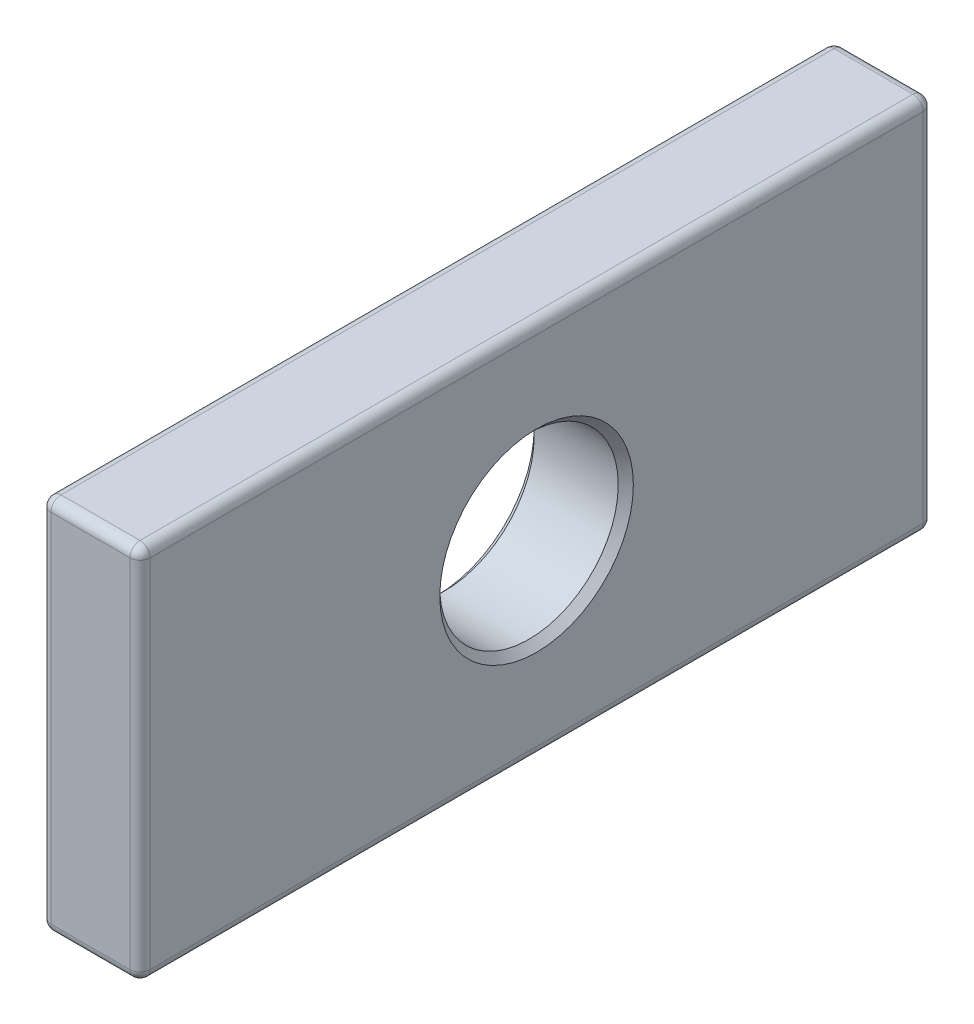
ISO-10303-21;
HEADER;
FILE_DESCRIPTION(('STEP AP214'),'2;1');
FILE_NAME('part.step','',(''),(''),'','','');
FILE_SCHEMA(('AUTOMOTIVE_DESIGN { 1 0 10303 214 1 1 1 1 }'));
ENDSEC;
DATA;
#1=APPLICATION_CONTEXT('core data for automotive mechanical design processes');
#2=APPLICATION_PROTOCOL_DEFINITION('international standard','automotive_design',2000,#1);
#3=PRODUCT_CONTEXT('',#1,'mechanical');
#4=PRODUCT('Part','Part','',(#3));
#5=PRODUCT_RELATED_PRODUCT_CATEGORY('part','',(#4));
#6=PRODUCT_DEFINITION_FORMATION('','',#4);
#7=PRODUCT_DEFINITION_CONTEXT('part definition',#1,'design');
#8=PRODUCT_DEFINITION('design','',#6,#7);
#9=PRODUCT_DEFINITION_SHAPE('','',#8);
#10=(LENGTH_UNIT() NAMED_UNIT(*) SI_UNIT(.MILLI.,.METRE.));
#11=(NAMED_UNIT(*) PLANE_ANGLE_UNIT() SI_UNIT($,.RADIAN.));
#12=(NAMED_UNIT(*) SI_UNIT($,.STERADIAN.) SOLID_ANGLE_UNIT());
#13=UNCERTAINTY_MEASURE_WITH_UNIT(LENGTH_MEASURE(1.E-05),#10,'distance_accuracy_value','');
#14=(GEOMETRIC_REPRESENTATION_CONTEXT(3) GLOBAL_UNCERTAINTY_ASSIGNED_CONTEXT((#13)) GLOBAL_UNIT_ASSIGNED_CONTEXT((#10,
#11,#12)) REPRESENTATION_CONTEXT('',''));
#15=CARTESIAN_POINT('',(0.,0.,0.));
#16=DIRECTION('',(0.,0.,1.));
#17=DIRECTION('',(1.,0.,0.));
#18=AXIS2_PLACEMENT_3D('',#15,#16,#17);
#19=CARTESIAN_POINT('',(5.,0.,0.));
#20=DIRECTION('',(1.,0.,0.));
#21=DIRECTION('',(0.,0.,-1.));
#22=AXIS2_PLACEMENT_3D('',#19,#20,#21);
#23=PLANE('',#22);
#24=CARTESIAN_POINT('',(5.,0.,0.));
#25=DIRECTION('',(1.,0.,0.));
#26=DIRECTION('',(0.,0.,-1.));
#27=AXIS2_PLACEMENT_3D('',#24,#25,#26);
#28=CIRCLE('',#27,9.76200000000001);
#29=CARTESIAN_POINT('',(5.,0.,-9.762));
#30=VERTEX_POINT('',#29);
#31=EDGE_CURVE('E11',#30,#30,#28,.F.);
#32=ORIENTED_EDGE('',*,*,#31,.T.);
#33=EDGE_LOOP('',(#32));
#34=FACE_BOUND('',#33,.T.);
#35=DIRECTION('',(0.,0.,-1.));
#36=VECTOR('',#35,1.);
#37=CARTESIAN_POINT('',(5.,-17.984,-40.));
#38=LINE('',#37,#36);
#39=CARTESIAN_POINT('',(5.,-17.984,38.984));
#40=VERTEX_POINT('',#39);
#41=CARTESIAN_POINT('',(5.,-17.984,-38.984));
#42=VERTEX_POINT('',#41);
#43=EDGE_CURVE('E130',#40,#42,#38,.T.);
#44=ORIENTED_EDGE('',*,*,#43,.T.);
#45=DIRECTION('',(0.,1.,0.));
#46=VECTOR('',#45,1.);
#47=CARTESIAN_POINT('',(5.,19.,-38.984));
#48=LINE('',#47,#46);
#49=CARTESIAN_POINT('',(5.,17.984,-38.984));
#50=VERTEX_POINT('',#49);
#51=EDGE_CURVE('E126',#42,#50,#48,.T.);
#52=ORIENTED_EDGE('',*,*,#51,.T.);
#53=DIRECTION('',(0.,0.,1.));
#54=VECTOR('',#53,1.);
#55=CARTESIAN_POINT('',(5.,17.984,40.));
#56=LINE('',#55,#54);
#57=CARTESIAN_POINT('',(5.,17.984,38.984));
#58=VERTEX_POINT('',#57);
#59=EDGE_CURVE('E119',#50,#58,#56,.T.);
#60=ORIENTED_EDGE('',*,*,#59,.T.);
#61=DIRECTION('',(0.,-1.,0.));
#62=VECTOR('',#61,1.);
#63=CARTESIAN_POINT('',(5.,-19.,38.984));
#64=LINE('',#63,#62);
#65=EDGE_CURVE('E123',#58,#40,#64,.T.);
#66=ORIENTED_EDGE('',*,*,#65,.T.);
#67=EDGE_LOOP('',(#44,#52,#60,#66));
#68=FACE_BOUND('',#67,.T.);
#69=ADVANCED_FACE('F32',(#34,#68),#23,.T.);
#70=CARTESIAN_POINT('',(-5.,0.,0.));
#71=DIRECTION('',(1.,0.,0.));
#72=DIRECTION('',(0.,0.,-1.));
#73=AXIS2_PLACEMENT_3D('',#70,#71,#72);
#74=PLANE('',#73);
#75=CARTESIAN_POINT('',(-5.,0.,0.));
#76=DIRECTION('',(1.,0.,0.));
#77=DIRECTION('',(0.,0.,-1.));
#78=AXIS2_PLACEMENT_3D('',#75,#76,#77);
#79=CIRCLE('',#78,9.76199999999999);
#80=CARTESIAN_POINT('',(-5.,0.,-9.76199999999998));
#81=VERTEX_POINT('',#80);
#82=EDGE_CURVE('E204',#81,#81,#79,.T.);
#83=ORIENTED_EDGE('',*,*,#82,.T.);
#84=EDGE_LOOP('',(#83));
#85=FACE_BOUND('',#84,.T.);
#86=DIRECTION('',(0.,0.,1.));
#87=VECTOR('',#86,1.);
#88=CARTESIAN_POINT('',(-5.,17.984,0.));
#89=LINE('',#88,#87);
#90=CARTESIAN_POINT('',(-5.,17.984,38.984));
#91=VERTEX_POINT('',#90);
#92=CARTESIAN_POINT('',(-5.,17.984,-38.984));
#93=VERTEX_POINT('',#92);
#94=EDGE_CURVE('E175',#91,#93,#89,.F.);
#95=ORIENTED_EDGE('',*,*,#94,.T.);
#96=DIRECTION('',(0.,1.,0.));
#97=VECTOR('',#96,1.);
#98=CARTESIAN_POINT('',(-5.,0.,-38.984));
#99=LINE('',#98,#97);
#100=CARTESIAN_POINT('',(-5.,-17.984,-38.984));
#101=VERTEX_POINT('',#100);
#102=EDGE_CURVE('E180',#93,#101,#99,.F.);
#103=ORIENTED_EDGE('',*,*,#102,.T.);
#104=DIRECTION('',(0.,0.,-1.));
#105=VECTOR('',#104,1.);
#106=CARTESIAN_POINT('',(-5.,-17.984,0.));
#107=LINE('',#106,#105);
#108=CARTESIAN_POINT('',(-5.,-17.984,38.984));
#109=VERTEX_POINT('',#108);
#110=EDGE_CURVE('E177',#101,#109,#107,.F.);
#111=ORIENTED_EDGE('',*,*,#110,.T.);
#112=DIRECTION('',(0.,-1.,0.));
#113=VECTOR('',#112,1.);
#114=CARTESIAN_POINT('',(-5.,0.,38.984));
#115=LINE('',#114,#113);
#116=EDGE_CURVE('E173',#109,#91,#115,.F.);
#117=ORIENTED_EDGE('',*,*,#116,.T.);
#118=EDGE_LOOP('',(#95,#103,#111,#117));
#119=FACE_BOUND('',#118,.T.);
#120=ADVANCED_FACE('F270',(#85,#119),#74,.F.);
#121=CARTESIAN_POINT('',(5.,19.,-40.));
#122=DIRECTION('',(0.,0.,1.));
#123=DIRECTION('',(1.,0.,0.));
#124=AXIS2_PLACEMENT_3D('',#121,#122,#123);
#125=PLANE('',#124);
#126=DIRECTION('',(0.,1.,0.));
#127=VECTOR('',#126,1.);
#128=CARTESIAN_POINT('',(3.984,-19.,-40.));
#129=LINE('',#128,#127);
#130=CARTESIAN_POINT('',(3.984,17.984,-40.));
#131=VERTEX_POINT('',#130);
#132=CARTESIAN_POINT('',(3.984,-17.984,-40.));
#133=VERTEX_POINT('',#132);
#134=EDGE_CURVE('E193',#131,#133,#129,.F.);
#135=ORIENTED_EDGE('',*,*,#134,.T.);
#136=DIRECTION('',(-1.,0.,0.));
#137=VECTOR('',#136,1.);
#138=CARTESIAN_POINT('',(5.,-17.984,-40.));
#139=LINE('',#138,#137);
#140=CARTESIAN_POINT('',(-3.984,-17.984,-40.));
#141=VERTEX_POINT('',#140);
#142=EDGE_CURVE('E195',#133,#141,#139,.T.);
#143=ORIENTED_EDGE('',*,*,#142,.T.);
#144=DIRECTION('',(0.,1.,0.));
#145=VECTOR('',#144,1.);
#146=CARTESIAN_POINT('',(-3.984,19.,-40.));
#147=LINE('',#146,#145);
#148=CARTESIAN_POINT('',(-3.984,17.984,-40.));
#149=VERTEX_POINT('',#148);
#150=EDGE_CURVE('E189',#141,#149,#147,.T.);
#151=ORIENTED_EDGE('',*,*,#150,.T.);
#152=DIRECTION('',(-1.,0.,0.));
#153=VECTOR('',#152,1.);
#154=CARTESIAN_POINT('',(5.,17.984,-40.));
#155=LINE('',#154,#153);
#156=EDGE_CURVE('E191',#149,#131,#155,.F.);
#157=ORIENTED_EDGE('',*,*,#156,.T.);
#158=EDGE_LOOP('',(#135,#143,#151,#157));
#159=FACE_BOUND('',#158,.T.);
#160=ADVANCED_FACE('F273',(#159),#125,.F.);
#161=CARTESIAN_POINT('',(5.,19.,40.));
#162=DIRECTION('',(0.,-1.,0.));
#163=DIRECTION('',(0.,0.,-1.));
#164=AXIS2_PLACEMENT_3D('',#161,#162,#163);
#165=PLANE('',#164);
#166=DIRECTION('',(0.,0.,1.));
#167=VECTOR('',#166,1.);
#168=CARTESIAN_POINT('',(3.984,19.,-40.));
#169=LINE('',#168,#167);
#170=CARTESIAN_POINT('',(3.984,19.,38.984));
#171=VERTEX_POINT('',#170);
#172=CARTESIAN_POINT('',(3.984,19.,-38.984));
#173=VERTEX_POINT('',#172);
#174=EDGE_CURVE('E138',#171,#173,#169,.F.);
#175=ORIENTED_EDGE('',*,*,#174,.T.);
#176=DIRECTION('',(-1.,0.,0.));
#177=VECTOR('',#176,1.);
#178=CARTESIAN_POINT('',(5.,19.,-38.984));
#179=LINE('',#178,#177);
#180=CARTESIAN_POINT('',(-3.984,19.,-38.984));
#181=VERTEX_POINT('',#180);
#182=EDGE_CURVE('E187',#173,#181,#179,.T.);
#183=ORIENTED_EDGE('',*,*,#182,.T.);
#184=DIRECTION('',(0.,0.,1.));
#185=VECTOR('',#184,1.);
#186=CARTESIAN_POINT('',(-3.984,19.,40.));
#187=LINE('',#186,#185);
#188=CARTESIAN_POINT('',(-3.984,19.,38.984));
#189=VERTEX_POINT('',#188);
#190=EDGE_CURVE('E184',#181,#189,#187,.T.);
#191=ORIENTED_EDGE('',*,*,#190,.T.);
#192=DIRECTION('',(-1.,0.,0.));
#193=VECTOR('',#192,1.);
#194=CARTESIAN_POINT('',(5.,19.,38.984));
#195=LINE('',#194,#193);
#196=EDGE_CURVE('E182',#189,#171,#195,.F.);
#197=ORIENTED_EDGE('',*,*,#196,.T.);
#198=EDGE_LOOP('',(#175,#183,#191,#197));
#199=FACE_BOUND('',#198,.T.);
#200=ADVANCED_FACE('F317',(#199),#165,.F.);
#201=CARTESIAN_POINT('',(5.,19.,40.));
#202=DIRECTION('',(0.,0.,-1.));
#203=DIRECTION('',(-1.,0.,0.));
#204=AXIS2_PLACEMENT_3D('',#201,#202,#203);
#205=PLANE('',#204);
#206=DIRECTION('',(0.,-1.,0.));
#207=VECTOR('',#206,1.);
#208=CARTESIAN_POINT('',(3.984,19.,40.));
#209=LINE('',#208,#207);
#210=CARTESIAN_POINT('',(3.984,-17.984,40.));
#211=VERTEX_POINT('',#210);
#212=CARTESIAN_POINT('',(3.984,17.984,40.));
#213=VERTEX_POINT('',#212);
#214=EDGE_CURVE('E47',#211,#213,#209,.F.);
#215=ORIENTED_EDGE('',*,*,#214,.T.);
#216=DIRECTION('',(-1.,0.,0.));
#217=VECTOR('',#216,1.);
#218=CARTESIAN_POINT('',(5.,17.984,40.));
#219=LINE('',#218,#217);
#220=CARTESIAN_POINT('',(-3.984,17.984,40.));
#221=VERTEX_POINT('',#220);
#222=EDGE_CURVE('E202',#213,#221,#219,.T.);
#223=ORIENTED_EDGE('',*,*,#222,.T.);
#224=DIRECTION('',(0.,-1.,0.));
#225=VECTOR('',#224,1.);
#226=CARTESIAN_POINT('',(-3.984,19.,40.));
#227=LINE('',#226,#225);
#228=CARTESIAN_POINT('',(-3.984,-17.984,40.));
#229=VERTEX_POINT('',#228);
#230=EDGE_CURVE('E198',#221,#229,#227,.T.);
#231=ORIENTED_EDGE('',*,*,#230,.T.);
#232=DIRECTION('',(-1.,0.,0.));
#233=VECTOR('',#232,1.);
#234=CARTESIAN_POINT('',(5.,-17.984,40.));
#235=LINE('',#234,#233);
#236=EDGE_CURVE('E52',#229,#211,#235,.F.);
#237=ORIENTED_EDGE('',*,*,#236,.T.);
#238=EDGE_LOOP('',(#215,#223,#231,#237));
#239=FACE_BOUND('',#238,.T.);
#240=ADVANCED_FACE('F314',(#239),#205,.F.);
#241=CARTESIAN_POINT('',(5.,-19.,40.));
#242=DIRECTION('',(0.,1.,0.));
#243=DIRECTION('',(0.,0.,1.));
#244=AXIS2_PLACEMENT_3D('',#241,#242,#243);
#245=PLANE('',#244);
#246=DIRECTION('',(0.,0.,-1.));
#247=VECTOR('',#246,1.);
#248=CARTESIAN_POINT('',(-3.984,-19.,40.));
#249=LINE('',#248,#247);
#250=CARTESIAN_POINT('',(-3.984,-19.,38.984));
#251=VERTEX_POINT('',#250);
#252=CARTESIAN_POINT('',(-3.984,-19.,-38.984));
#253=VERTEX_POINT('',#252);
#254=EDGE_CURVE('E166',#251,#253,#249,.T.);
#255=ORIENTED_EDGE('',*,*,#254,.T.);
#256=DIRECTION('',(-1.,0.,0.));
#257=VECTOR('',#256,1.);
#258=CARTESIAN_POINT('',(5.,-19.,-38.984));
#259=LINE('',#258,#257);
#260=CARTESIAN_POINT('',(3.984,-19.,-38.984));
#261=VERTEX_POINT('',#260);
#262=EDGE_CURVE('E171',#253,#261,#259,.F.);
#263=ORIENTED_EDGE('',*,*,#262,.T.);
#264=DIRECTION('',(0.,0.,-1.));
#265=VECTOR('',#264,1.);
#266=CARTESIAN_POINT('',(3.984,-19.,40.));
#267=LINE('',#266,#265);
#268=CARTESIAN_POINT('',(3.984,-19.,38.984));
#269=VERTEX_POINT('',#268);
#270=EDGE_CURVE('E168',#261,#269,#267,.F.);
#271=ORIENTED_EDGE('',*,*,#270,.T.);
#272=DIRECTION('',(-1.,0.,0.));
#273=VECTOR('',#272,1.);
#274=CARTESIAN_POINT('',(5.,-19.,38.984));
#275=LINE('',#274,#273);
#276=EDGE_CURVE('E164',#269,#251,#275,.T.);
#277=ORIENTED_EDGE('',*,*,#276,.T.);
#278=EDGE_LOOP('',(#255,#263,#271,#277));
#279=FACE_BOUND('',#278,.T.);
#280=ADVANCED_FACE('F316',(#279),#245,.F.);
#281=CARTESIAN_POINT('',(5.,0.,0.));
#282=DIRECTION('',(-1.,0.,0.));
#283=DIRECTION('',(0.,0.,1.));
#284=AXIS2_PLACEMENT_3D('',#281,#282,#283);
#285=CYLINDRICAL_SURFACE('',#284,9.);
#286=CARTESIAN_POINT('',(-4.23800000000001,0.,0.));
#287=DIRECTION('',(1.,0.,0.));
#288=DIRECTION('',(0.,0.,-1.));
#289=AXIS2_PLACEMENT_3D('',#286,#287,#288);
#290=CIRCLE('',#289,9.);
#291=CARTESIAN_POINT('',(-4.23800000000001,0.,-8.99999999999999));
#292=VERTEX_POINT('',#291);
#293=EDGE_CURVE('E40',#292,#292,#290,.F.);
#294=ORIENTED_EDGE('',*,*,#293,.T.);
#295=EDGE_LOOP('',(#294));
#296=FACE_BOUND('',#295,.T.);
#297=CARTESIAN_POINT('',(4.23799999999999,0.,0.));
#298=DIRECTION('',(1.,0.,0.));
#299=DIRECTION('',(0.,0.,-1.));
#300=AXIS2_PLACEMENT_3D('',#297,#298,#299);
#301=CIRCLE('',#300,9.);
#302=CARTESIAN_POINT('',(4.23799999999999,0.,-8.99999999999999));
#303=VERTEX_POINT('',#302);
#304=EDGE_CURVE('E256',#303,#303,#301,.T.);
#305=ORIENTED_EDGE('',*,*,#304,.T.);
#306=EDGE_LOOP('',(#305));
#307=FACE_BOUND('',#306,.T.);
#308=ADVANCED_FACE('F261',(#296,#307),#285,.F.);
#309=CARTESIAN_POINT('',(-3.984,17.984,40.));
#310=DIRECTION('',(0.,0.,1.));
#311=DIRECTION('',(1.,0.,0.));
#312=AXIS2_PLACEMENT_3D('',#309,#310,#311);
#313=CYLINDRICAL_SURFACE('',#312,1.016);
#314=CARTESIAN_POINT('',(-3.984,17.984,38.984));
#315=DIRECTION('',(0.,0.,1.));
#316=DIRECTION('',(1.,0.,0.));
#317=AXIS2_PLACEMENT_3D('',#314,#315,#316);
#318=CIRCLE('',#317,1.016);
#319=EDGE_CURVE('E156',#189,#91,#318,.T.);
#320=ORIENTED_EDGE('',*,*,#319,.F.);
#321=ORIENTED_EDGE('',*,*,#190,.F.);
#322=CARTESIAN_POINT('',(-3.984,17.984,-38.984));
#323=DIRECTION('',(0.,0.,-1.));
#324=DIRECTION('',(-1.,0.,0.));
#325=AXIS2_PLACEMENT_3D('',#322,#323,#324);
#326=CIRCLE('',#325,1.016);
#327=EDGE_CURVE('E159',#93,#181,#326,.T.);
#328=ORIENTED_EDGE('',*,*,#327,.F.);
#329=ORIENTED_EDGE('',*,*,#94,.F.);
#330=EDGE_LOOP('',(#320,#321,#328,#329));
#331=FACE_BOUND('',#330,.T.);
#332=ADVANCED_FACE('F284',(#331),#313,.T.);
#333=CARTESIAN_POINT('',(-3.984,17.984,38.984));
#334=DIRECTION('',(0.,0.,1.));
#335=DIRECTION('',(1.,0.,0.));
#336=AXIS2_PLACEMENT_3D('',#333,#334,#335);
#337=SPHERICAL_SURFACE('',#336,1.016);
#338=CARTESIAN_POINT('',(-3.984,17.984,38.984));
#339=DIRECTION('',(-1.,0.,0.));
#340=DIRECTION('',(0.,0.,1.));
#341=AXIS2_PLACEMENT_3D('',#338,#339,#340);
#342=CIRCLE('',#341,1.016);
#343=EDGE_CURVE('E246',#189,#221,#342,.F.);
#344=ORIENTED_EDGE('',*,*,#343,.F.);
#345=ORIENTED_EDGE('',*,*,#319,.T.);
#346=CARTESIAN_POINT('',(-3.984,17.984,38.984));
#347=DIRECTION('',(0.,1.,0.));
#348=DIRECTION('',(0.,0.,1.));
#349=AXIS2_PLACEMENT_3D('',#346,#347,#348);
#350=CIRCLE('',#349,1.016);
#351=EDGE_CURVE('E249',#221,#91,#350,.F.);
#352=ORIENTED_EDGE('',*,*,#351,.F.);
#353=EDGE_LOOP('',(#344,#345,#352));
#354=FACE_BOUND('',#353,.T.);
#355=ADVANCED_FACE('F310',(#354),#337,.T.);
#356=CARTESIAN_POINT('',(-3.984,17.984,-38.984));
#357=DIRECTION('',(0.,0.,1.));
#358=DIRECTION('',(1.,0.,0.));
#359=AXIS2_PLACEMENT_3D('',#356,#357,#358);
#360=SPHERICAL_SURFACE('',#359,1.016);
#361=CARTESIAN_POINT('',(-3.984,17.984,-38.984));
#362=DIRECTION('',(0.,1.,0.));
#363=DIRECTION('',(0.,0.,1.));
#364=AXIS2_PLACEMENT_3D('',#361,#362,#363);
#365=CIRCLE('',#364,1.016);
#366=EDGE_CURVE('E240',#93,#149,#365,.F.);
#367=ORIENTED_EDGE('',*,*,#366,.F.);
#368=ORIENTED_EDGE('',*,*,#327,.T.);
#369=CARTESIAN_POINT('',(-3.984,17.984,-38.984));
#370=DIRECTION('',(-1.,0.,0.));
#371=DIRECTION('',(0.,0.,1.));
#372=AXIS2_PLACEMENT_3D('',#369,#370,#371);
#373=CIRCLE('',#372,1.016);
#374=EDGE_CURVE('E243',#149,#181,#373,.F.);
#375=ORIENTED_EDGE('',*,*,#374,.F.);
#376=EDGE_LOOP('',(#367,#368,#375));
#377=FACE_BOUND('',#376,.T.);
#378=ADVANCED_FACE('F287',(#377),#360,.T.);
#379=CARTESIAN_POINT('',(-3.984,19.,38.984));
#380=DIRECTION('',(0.,-1.,0.));
#381=DIRECTION('',(0.,0.,-1.));
#382=AXIS2_PLACEMENT_3D('',#379,#380,#381);
#383=CYLINDRICAL_SURFACE('',#382,1.016);
#384=ORIENTED_EDGE('',*,*,#351,.T.);
#385=ORIENTED_EDGE('',*,*,#116,.F.);
#386=CARTESIAN_POINT('',(-3.984,-17.984,38.984));
#387=DIRECTION('',(0.,-1.,0.));
#388=DIRECTION('',(0.,0.,-1.));
#389=AXIS2_PLACEMENT_3D('',#386,#387,#388);
#390=CIRCLE('',#389,1.016);
#391=EDGE_CURVE('E235',#229,#109,#390,.T.);
#392=ORIENTED_EDGE('',*,*,#391,.F.);
#393=ORIENTED_EDGE('',*,*,#230,.F.);
#394=EDGE_LOOP('',(#384,#385,#392,#393));
#395=FACE_BOUND('',#394,.T.);
#396=ADVANCED_FACE('F306',(#395),#383,.T.);
#397=CARTESIAN_POINT('',(5.,17.984,38.984));
#398=DIRECTION('',(-1.,0.,0.));
#399=DIRECTION('',(0.,0.,1.));
#400=AXIS2_PLACEMENT_3D('',#397,#398,#399);
#401=CYLINDRICAL_SURFACE('',#400,1.016);
#402=ORIENTED_EDGE('',*,*,#343,.T.);
#403=ORIENTED_EDGE('',*,*,#222,.F.);
#404=CARTESIAN_POINT('',(3.984,17.984,38.984));
#405=DIRECTION('',(1.,0.,0.));
#406=DIRECTION('',(0.,0.,-1.));
#407=AXIS2_PLACEMENT_3D('',#404,#405,#406);
#408=CIRCLE('',#407,1.016);
#409=EDGE_CURVE('E142',#171,#213,#408,.T.);
#410=ORIENTED_EDGE('',*,*,#409,.F.);
#411=ORIENTED_EDGE('',*,*,#196,.F.);
#412=EDGE_LOOP('',(#402,#403,#410,#411));
#413=FACE_BOUND('',#412,.T.);
#414=ADVANCED_FACE('F313',(#413),#401,.T.);
#415=CARTESIAN_POINT('',(3.984,17.984,0.));
#416=DIRECTION('',(0.,0.,-1.));
#417=DIRECTION('',(-1.,0.,0.));
#418=AXIS2_PLACEMENT_3D('',#415,#416,#417);
#419=CYLINDRICAL_SURFACE('',#418,1.016);
#420=CARTESIAN_POINT('',(3.984,17.984,-38.984));
#421=DIRECTION('',(0.,0.,-1.));
#422=DIRECTION('',(-1.,0.,0.));
#423=AXIS2_PLACEMENT_3D('',#420,#421,#422);
#424=CIRCLE('',#423,1.016);
#425=EDGE_CURVE('E143',#173,#50,#424,.T.);
#426=ORIENTED_EDGE('',*,*,#425,.F.);
#427=ORIENTED_EDGE('',*,*,#174,.F.);
#428=CARTESIAN_POINT('',(3.984,17.984,38.984));
#429=DIRECTION('',(0.,0.,1.));
#430=DIRECTION('',(1.,0.,0.));
#431=AXIS2_PLACEMENT_3D('',#428,#429,#430);
#432=CIRCLE('',#431,1.016);
#433=EDGE_CURVE('E134',#58,#171,#432,.T.);
#434=ORIENTED_EDGE('',*,*,#433,.F.);
#435=ORIENTED_EDGE('',*,*,#59,.F.);
#436=EDGE_LOOP('',(#426,#427,#434,#435));
#437=FACE_BOUND('',#436,.T.);
#438=ADVANCED_FACE('F136',(#437),#419,.T.);
#439=CARTESIAN_POINT('',(5.,17.984,-38.984));
#440=DIRECTION('',(-1.,0.,0.));
#441=DIRECTION('',(0.,0.,1.));
#442=AXIS2_PLACEMENT_3D('',#439,#440,#441);
#443=CYLINDRICAL_SURFACE('',#442,1.016);
#444=ORIENTED_EDGE('',*,*,#374,.T.);
#445=ORIENTED_EDGE('',*,*,#182,.F.);
#446=CARTESIAN_POINT('',(3.984,17.984,-38.984));
#447=DIRECTION('',(1.,0.,0.));
#448=DIRECTION('',(0.,0.,-1.));
#449=AXIS2_PLACEMENT_3D('',#446,#447,#448);
#450=CIRCLE('',#449,1.016);
#451=EDGE_CURVE('E231',#131,#173,#450,.T.);
#452=ORIENTED_EDGE('',*,*,#451,.F.);
#453=ORIENTED_EDGE('',*,*,#156,.F.);
#454=EDGE_LOOP('',(#444,#445,#452,#453));
#455=FACE_BOUND('',#454,.T.);
#456=ADVANCED_FACE('F351',(#455),#443,.T.);
#457=CARTESIAN_POINT('',(-3.984,19.,-38.984));
#458=DIRECTION('',(0.,1.,0.));
#459=DIRECTION('',(0.,0.,1.));
#460=AXIS2_PLACEMENT_3D('',#457,#458,#459);
#461=CYLINDRICAL_SURFACE('',#460,1.016);
#462=ORIENTED_EDGE('',*,*,#366,.T.);
#463=ORIENTED_EDGE('',*,*,#150,.F.);
#464=CARTESIAN_POINT('',(-3.984,-17.984,-38.984));
#465=DIRECTION('',(0.,-1.,0.));
#466=DIRECTION('',(0.,0.,-1.));
#467=AXIS2_PLACEMENT_3D('',#464,#465,#466);
#468=CIRCLE('',#467,1.016);
#469=EDGE_CURVE('E228',#101,#141,#468,.T.);
#470=ORIENTED_EDGE('',*,*,#469,.F.);
#471=ORIENTED_EDGE('',*,*,#102,.F.);
#472=EDGE_LOOP('',(#462,#463,#470,#471));
#473=FACE_BOUND('',#472,.T.);
#474=ADVANCED_FACE('F292',(#473),#461,.T.);
#475=CARTESIAN_POINT('',(-3.984,-17.984,40.));
#476=DIRECTION('',(0.,0.,-1.));
#477=DIRECTION('',(-1.,0.,0.));
#478=AXIS2_PLACEMENT_3D('',#475,#476,#477);
#479=CYLINDRICAL_SURFACE('',#478,1.016);
#480=CARTESIAN_POINT('',(-3.984,-17.984,38.984));
#481=DIRECTION('',(0.,0.,1.));
#482=DIRECTION('',(1.,0.,0.));
#483=AXIS2_PLACEMENT_3D('',#480,#481,#482);
#484=CIRCLE('',#483,1.016);
#485=EDGE_CURVE('E237',#109,#251,#484,.T.);
#486=ORIENTED_EDGE('',*,*,#485,.F.);
#487=ORIENTED_EDGE('',*,*,#110,.F.);
#488=CARTESIAN_POINT('',(-3.984,-17.984,-38.984));
#489=DIRECTION('',(0.,0.,-1.));
#490=DIRECTION('',(-1.,0.,0.));
#491=AXIS2_PLACEMENT_3D('',#488,#489,#490);
#492=CIRCLE('',#491,1.016);
#493=EDGE_CURVE('E225',#253,#101,#492,.T.);
#494=ORIENTED_EDGE('',*,*,#493,.F.);
#495=ORIENTED_EDGE('',*,*,#254,.F.);
#496=EDGE_LOOP('',(#486,#487,#494,#495));
#497=FACE_BOUND('',#496,.T.);
#498=ADVANCED_FACE('F301',(#497),#479,.T.);
#499=CARTESIAN_POINT('',(-3.984,-17.984,38.984));
#500=DIRECTION('',(0.,0.,1.));
#501=DIRECTION('',(1.,0.,0.));
#502=AXIS2_PLACEMENT_3D('',#499,#500,#501);
#503=SPHERICAL_SURFACE('',#502,1.016);
#504=ORIENTED_EDGE('',*,*,#391,.T.);
#505=ORIENTED_EDGE('',*,*,#485,.T.);
#506=CARTESIAN_POINT('',(-3.984,-17.984,38.984));
#507=DIRECTION('',(-1.,0.,0.));
#508=DIRECTION('',(0.,0.,1.));
#509=AXIS2_PLACEMENT_3D('',#506,#507,#508);
#510=CIRCLE('',#509,1.016);
#511=EDGE_CURVE('E149',#229,#251,#510,.F.);
#512=ORIENTED_EDGE('',*,*,#511,.F.);
#513=EDGE_LOOP('',(#504,#505,#512));
#514=FACE_BOUND('',#513,.T.);
#515=ADVANCED_FACE('F359',(#514),#503,.T.);
#516=CARTESIAN_POINT('',(3.984,17.984,38.984));
#517=DIRECTION('',(0.,0.,1.));
#518=DIRECTION('',(1.,0.,0.));
#519=AXIS2_PLACEMENT_3D('',#516,#517,#518);
#520=SPHERICAL_SURFACE('',#519,1.016);
#521=ORIENTED_EDGE('',*,*,#433,.T.);
#522=ORIENTED_EDGE('',*,*,#409,.T.);
#523=CARTESIAN_POINT('',(3.984,17.984,38.984));
#524=DIRECTION('',(0.,1.,0.));
#525=DIRECTION('',(0.,0.,1.));
#526=AXIS2_PLACEMENT_3D('',#523,#524,#525);
#527=CIRCLE('',#526,1.016);
#528=EDGE_CURVE('E146',#58,#213,#527,.F.);
#529=ORIENTED_EDGE('',*,*,#528,.F.);
#530=EDGE_LOOP('',(#521,#522,#529));
#531=FACE_BOUND('',#530,.T.);
#532=ADVANCED_FACE('F147',(#531),#520,.T.);
#533=CARTESIAN_POINT('',(3.984,17.984,-38.984));
#534=DIRECTION('',(0.,0.,1.));
#535=DIRECTION('',(1.,0.,0.));
#536=AXIS2_PLACEMENT_3D('',#533,#534,#535);
#537=SPHERICAL_SURFACE('',#536,1.016);
#538=ORIENTED_EDGE('',*,*,#451,.T.);
#539=ORIENTED_EDGE('',*,*,#425,.T.);
#540=CARTESIAN_POINT('',(3.984,17.984,-38.984));
#541=DIRECTION('',(0.,1.,0.));
#542=DIRECTION('',(0.,0.,1.));
#543=AXIS2_PLACEMENT_3D('',#540,#541,#542);
#544=CIRCLE('',#543,1.016);
#545=EDGE_CURVE('E150',#131,#50,#544,.F.);
#546=ORIENTED_EDGE('',*,*,#545,.F.);
#547=EDGE_LOOP('',(#538,#539,#546));
#548=FACE_BOUND('',#547,.T.);
#549=ADVANCED_FACE('F364',(#548),#537,.T.);
#550=CARTESIAN_POINT('',(-3.984,-17.984,-38.984));
#551=DIRECTION('',(0.,0.,1.));
#552=DIRECTION('',(1.,0.,0.));
#553=AXIS2_PLACEMENT_3D('',#550,#551,#552);
#554=SPHERICAL_SURFACE('',#553,1.016);
#555=ORIENTED_EDGE('',*,*,#493,.T.);
#556=ORIENTED_EDGE('',*,*,#469,.T.);
#557=CARTESIAN_POINT('',(-3.984,-17.984,-38.984));
#558=DIRECTION('',(-1.,0.,0.));
#559=DIRECTION('',(0.,0.,1.));
#560=AXIS2_PLACEMENT_3D('',#557,#558,#559);
#561=CIRCLE('',#560,1.016);
#562=EDGE_CURVE('E219',#253,#141,#561,.F.);
#563=ORIENTED_EDGE('',*,*,#562,.F.);
#564=EDGE_LOOP('',(#555,#556,#563));
#565=FACE_BOUND('',#564,.T.);
#566=ADVANCED_FACE('F296',(#565),#554,.T.);
#567=CARTESIAN_POINT('',(5.,-17.984,38.984));
#568=DIRECTION('',(-1.,0.,0.));
#569=DIRECTION('',(0.,0.,1.));
#570=AXIS2_PLACEMENT_3D('',#567,#568,#569);
#571=CYLINDRICAL_SURFACE('',#570,1.016);
#572=ORIENTED_EDGE('',*,*,#511,.T.);
#573=ORIENTED_EDGE('',*,*,#276,.F.);
#574=CARTESIAN_POINT('',(3.984,-17.984,38.984));
#575=DIRECTION('',(1.,0.,0.));
#576=DIRECTION('',(0.,0.,-1.));
#577=AXIS2_PLACEMENT_3D('',#574,#575,#576);
#578=CIRCLE('',#577,1.016);
#579=EDGE_CURVE('E216',#211,#269,#578,.T.);
#580=ORIENTED_EDGE('',*,*,#579,.F.);
#581=ORIENTED_EDGE('',*,*,#236,.F.);
#582=EDGE_LOOP('',(#572,#573,#580,#581));
#583=FACE_BOUND('',#582,.T.);
#584=ADVANCED_FACE('F370',(#583),#571,.T.);
#585=CARTESIAN_POINT('',(3.984,0.,38.984));
#586=DIRECTION('',(0.,1.,0.));
#587=DIRECTION('',(0.,0.,1.));
#588=AXIS2_PLACEMENT_3D('',#585,#586,#587);
#589=CYLINDRICAL_SURFACE('',#588,1.016);
#590=ORIENTED_EDGE('',*,*,#528,.T.);
#591=ORIENTED_EDGE('',*,*,#214,.F.);
#592=CARTESIAN_POINT('',(3.984,-17.984,38.984));
#593=DIRECTION('',(0.,-1.,0.));
#594=DIRECTION('',(0.,0.,-1.));
#595=AXIS2_PLACEMENT_3D('',#592,#593,#594);
#596=CIRCLE('',#595,1.016);
#597=EDGE_CURVE('E154',#40,#211,#596,.T.);
#598=ORIENTED_EDGE('',*,*,#597,.F.);
#599=ORIENTED_EDGE('',*,*,#65,.F.);
#600=EDGE_LOOP('',(#590,#591,#598,#599));
#601=FACE_BOUND('',#600,.T.);
#602=ADVANCED_FACE('F152',(#601),#589,.T.);
#603=CARTESIAN_POINT('',(3.984,0.,-38.984));
#604=DIRECTION('',(0.,-1.,0.));
#605=DIRECTION('',(0.,0.,-1.));
#606=AXIS2_PLACEMENT_3D('',#603,#604,#605);
#607=CYLINDRICAL_SURFACE('',#606,1.016);
#608=ORIENTED_EDGE('',*,*,#545,.T.);
#609=ORIENTED_EDGE('',*,*,#51,.F.);
#610=CARTESIAN_POINT('',(3.984,-17.984,-38.984));
#611=DIRECTION('',(0.,-1.,0.));
#612=DIRECTION('',(1.,0.,0.));
#613=AXIS2_PLACEMENT_3D('',#610,#611,#612);
#614=CIRCLE('',#613,1.016);
#615=EDGE_CURVE('E212',#133,#42,#614,.T.);
#616=ORIENTED_EDGE('',*,*,#615,.F.);
#617=ORIENTED_EDGE('',*,*,#134,.F.);
#618=EDGE_LOOP('',(#608,#609,#616,#617));
#619=FACE_BOUND('',#618,.T.);
#620=ADVANCED_FACE('F376',(#619),#607,.T.);
#621=CARTESIAN_POINT('',(5.,-17.984,-38.984));
#622=DIRECTION('',(-1.,0.,0.));
#623=DIRECTION('',(0.,0.,1.));
#624=AXIS2_PLACEMENT_3D('',#621,#622,#623);
#625=CYLINDRICAL_SURFACE('',#624,1.016);
#626=ORIENTED_EDGE('',*,*,#562,.T.);
#627=ORIENTED_EDGE('',*,*,#142,.F.);
#628=CARTESIAN_POINT('',(3.984,-17.984,-38.984));
#629=DIRECTION('',(1.,0.,0.));
#630=DIRECTION('',(0.,0.,-1.));
#631=AXIS2_PLACEMENT_3D('',#628,#629,#630);
#632=CIRCLE('',#631,1.016);
#633=EDGE_CURVE('E209',#261,#133,#632,.T.);
#634=ORIENTED_EDGE('',*,*,#633,.F.);
#635=ORIENTED_EDGE('',*,*,#262,.F.);
#636=EDGE_LOOP('',(#626,#627,#634,#635));
#637=FACE_BOUND('',#636,.T.);
#638=ADVANCED_FACE('F379',(#637),#625,.T.);
#639=CARTESIAN_POINT('',(3.984,-17.984,38.984));
#640=DIRECTION('',(0.,0.,1.));
#641=DIRECTION('',(1.,0.,0.));
#642=AXIS2_PLACEMENT_3D('',#639,#640,#641);
#643=SPHERICAL_SURFACE('',#642,1.016);
#644=ORIENTED_EDGE('',*,*,#597,.T.);
#645=ORIENTED_EDGE('',*,*,#579,.T.);
#646=CARTESIAN_POINT('',(3.984,-17.984,38.984));
#647=DIRECTION('',(0.,0.,1.));
#648=DIRECTION('',(1.,0.,0.));
#649=AXIS2_PLACEMENT_3D('',#646,#647,#648);
#650=CIRCLE('',#649,1.016);
#651=EDGE_CURVE('E207',#40,#269,#650,.F.);
#652=ORIENTED_EDGE('',*,*,#651,.F.);
#653=EDGE_LOOP('',(#644,#645,#652));
#654=FACE_BOUND('',#653,.T.);
#655=ADVANCED_FACE('F383',(#654),#643,.T.);
#656=CARTESIAN_POINT('',(3.984,-17.984,-38.984));
#657=DIRECTION('',(0.,0.,1.));
#658=DIRECTION('',(1.,0.,0.));
#659=AXIS2_PLACEMENT_3D('',#656,#657,#658);
#660=SPHERICAL_SURFACE('',#659,1.016);
#661=ORIENTED_EDGE('',*,*,#633,.T.);
#662=ORIENTED_EDGE('',*,*,#615,.T.);
#663=CARTESIAN_POINT('',(3.984,-17.984,-38.984));
#664=DIRECTION('',(0.,0.,-1.));
#665=DIRECTION('',(-1.,0.,0.));
#666=AXIS2_PLACEMENT_3D('',#663,#664,#665);
#667=CIRCLE('',#666,1.016);
#668=EDGE_CURVE('E205',#261,#42,#667,.F.);
#669=ORIENTED_EDGE('',*,*,#668,.F.);
#670=EDGE_LOOP('',(#661,#662,#669));
#671=FACE_BOUND('',#670,.T.);
#672=ADVANCED_FACE('F387',(#671),#660,.T.);
#673=CARTESIAN_POINT('',(3.984,-17.984,0.));
#674=DIRECTION('',(0.,0.,1.));
#675=DIRECTION('',(1.,0.,0.));
#676=AXIS2_PLACEMENT_3D('',#673,#674,#675);
#677=CYLINDRICAL_SURFACE('',#676,1.016);
#678=ORIENTED_EDGE('',*,*,#651,.T.);
#679=ORIENTED_EDGE('',*,*,#270,.F.);
#680=ORIENTED_EDGE('',*,*,#668,.T.);
#681=ORIENTED_EDGE('',*,*,#43,.F.);
#682=EDGE_LOOP('',(#678,#679,#680,#681));
#683=FACE_BOUND('',#682,.T.);
#684=ADVANCED_FACE('F267',(#683),#677,.T.);
#685=CARTESIAN_POINT('',(-5.,0.,0.));
#686=DIRECTION('',(-1.,0.,0.));
#687=DIRECTION('',(0.,0.,1.));
#688=AXIS2_PLACEMENT_3D('',#685,#686,#687);
#689=CONICAL_SURFACE('',#688,9.76199999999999,0.785398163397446);
#690=ORIENTED_EDGE('',*,*,#293,.F.);
#691=EDGE_LOOP('',(#690));
#692=FACE_BOUND('',#691,.T.);
#693=ORIENTED_EDGE('',*,*,#82,.F.);
#694=EDGE_LOOP('',(#693));
#695=FACE_BOUND('',#694,.T.);
#696=ADVANCED_FACE('F264',(#692,#695),#689,.F.);
#697=CARTESIAN_POINT('',(4.23799999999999,0.,0.));
#698=DIRECTION('',(1.,0.,0.));
#699=DIRECTION('',(0.,0.,-1.));
#700=AXIS2_PLACEMENT_3D('',#697,#698,#699);
#701=CONICAL_SURFACE('',#700,9.,0.785398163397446);
#702=ORIENTED_EDGE('',*,*,#31,.F.);
#703=EDGE_LOOP('',(#702));
#704=FACE_BOUND('',#703,.T.);
#705=ORIENTED_EDGE('',*,*,#304,.F.);
#706=EDGE_LOOP('',(#705));
#707=FACE_BOUND('',#706,.T.);
#708=ADVANCED_FACE('F34',(#704,#707),#701,.F.);
#709=CLOSED_SHELL('',(#69,#120,#160,#200,#240,#280,#308,#332,#355,#378,#396,#414,#438,#456,#474,
#498,#515,#532,#549,#566,#584,#602,#620,#638,#655,#672,#684,#696,#708));
#710=MANIFOLD_SOLID_BREP('B2',#709);
#711=ADVANCED_BREP_SHAPE_REPRESENTATION('',(#18,#710),#14);
#712=SHAPE_DEFINITION_REPRESENTATION(#9,#711);
ENDSEC;
END-ISO-10303-21;
